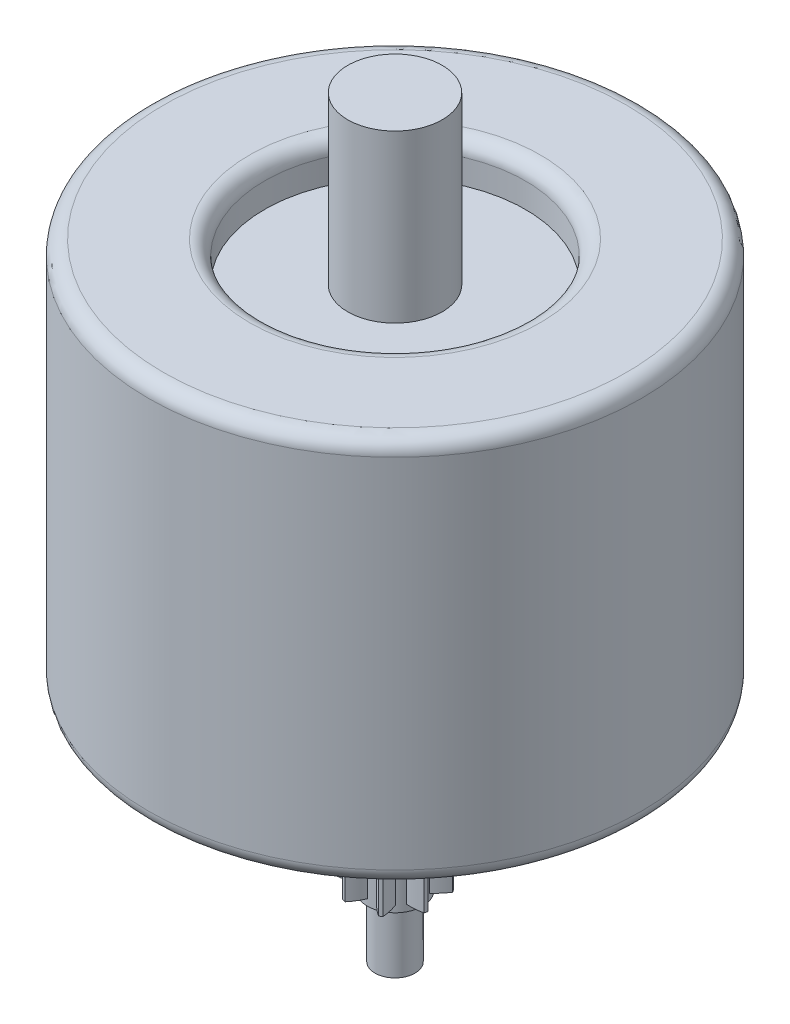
from build123d import *

# Parameters (mm, degrees)
SKETCH1_R           = 16.45
BOSS_EXTRUDE1_DEPTH = 25.85
SKETCH2_R           = 8.7
CUT_EXTRUDE1_DEPTH  = 2.65
SKETCH3_R           = 3.15
BOSS_EXTRUDE2_DEPTH = 11.1
CUT_EXTRUDE2_START  = -3.2
SKETCH4_R           = 8.7
CUT_EXTRUDE2_DEPTH  = 3.2
SKETCH5_R           = 1.335
BOSS_EXTRUDE3_DEPTH = 19.12
SKETCH6_R           = 2.825
BOSS_EXTRUDE4_DEPTH = 14.56
FILLET1_R           = 1
CUT_EXTRUDE9_START  = -14.56
CUT_EXTRUDE9_DEPTH  = 14.56
CIRPATTERN3_COUNT   = 8
SKETCH16_R          = 1.835
BOSS_EXTRUDE6_DEPTH = 15


with BuildPart() as part:
    # Sketch1 → Boss-Extrude1 (new body)
    with BuildSketch(Plane(origin=(0, 0, 0), x_dir=(1, 0, 0), z_dir=(0, 1, 0))):
        with Locations(Location((0, 0, 0), (0, 0, 270))):
            Circle(SKETCH1_R)
    extrude(amount=BOSS_EXTRUDE1_DEPTH)

    # Sketch2 → Cut-Extrude1 (cut)
    with BuildSketch(Plane(origin=(0, 25.85, 0), x_dir=(1, 0, 0), z_dir=(0, 1, 0))):
        with Locations(Location((0, 0, 0), (0, 0, 270))):
            Circle(SKETCH2_R)
    extrude(amount=-CUT_EXTRUDE1_DEPTH, mode=Mode.SUBTRACT)

    # Sketch3 → Boss-Extrude2 (add)
    with BuildSketch(Plane(origin=(0, 23.2, 0), x_dir=(1, 0, 0), z_dir=(0, 1, 0))):
        with Locations(Location((0, 0, 0), (0, 0, 270))):
            Circle(SKETCH3_R)
    extrude(amount=BOSS_EXTRUDE2_DEPTH)

    # Sketch4 → Cut-Extrude2 (cut)
    with BuildSketch(Plane.XZ.offset(CUT_EXTRUDE2_START)):
        with Locations(Location((0, 0, 0), (0, 0, 90))):
            Circle(SKETCH4_R)
    extrude(amount=CUT_EXTRUDE2_DEPTH, mode=Mode.SUBTRACT)

    # Sketch5 → Boss-Extrude3 (add)
    with BuildSketch(Plane.XZ.offset(-3.2)):
        with Locations(Location((0, 0, 0), (0, 0, 270))):
            Circle(SKETCH5_R)
    extrude(amount=BOSS_EXTRUDE3_DEPTH)

    # Sketch6 → Boss-Extrude4 (add)
    with BuildSketch(Plane.XZ.offset(-3.2)):
        with Locations(Location((0, 0, 0), (0, 0, 270))):
            Circle(SKETCH6_R)
    extrude(amount=BOSS_EXTRUDE4_DEPTH)

    # Fillet1
    fillet1_edges = [part.edges().sort_by_distance(p)[0] for p in [
        (0, 0, -8.7),
        (0, 0, -16.45),
        (0, 25.85, -16.45),
        (0, 25.85, -8.7),
    ]]
    fillet(fillet1_edges, radius=FILLET1_R)

    # Sketch15 → Cut-Extrude9 (cut)
    with BuildSketch(Plane.XZ.offset(11.36).offset(CUT_EXTRUDE9_START)):
        with BuildLine():
            ThreePointArc((1.372148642, 2.469379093), (0.431099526, 2.791913), (-0.563406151, 2.768248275))
            ThreePointArc((-0.563406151, 2.768248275), (-0.104815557, 2.083529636), (0.203723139, 1.319364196))
            ThreePointArc((0.203723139, 1.319364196), (0.728385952, 1.954874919), (1.372148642, 2.469379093))
        make_face()
    cut_extrude9 = extrude(amount=CUT_EXTRUDE9_DEPTH, mode=Mode.SUBTRACT)

    # CirPattern3: Cut-Extrude9 ×8 about axis
    cirpattern3_axis = Axis((0, 0, 0), (0, 1, 0))
    for i in range(1, CIRPATTERN3_COUNT):
        add(cut_extrude9.rotate(cirpattern3_axis, i * 360 / CIRPATTERN3_COUNT), mode=Mode.SUBTRACT)

    # Sketch16 → Boss-Extrude6 (add)
    with BuildSketch(Plane.XZ.offset(-3.2)):
        with Locations(Location((0, 0, 0), (0, 0, 89.500330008))):
            Circle(SKETCH16_R)
    extrude(amount=BOSS_EXTRUDE6_DEPTH)


solid = part.part
